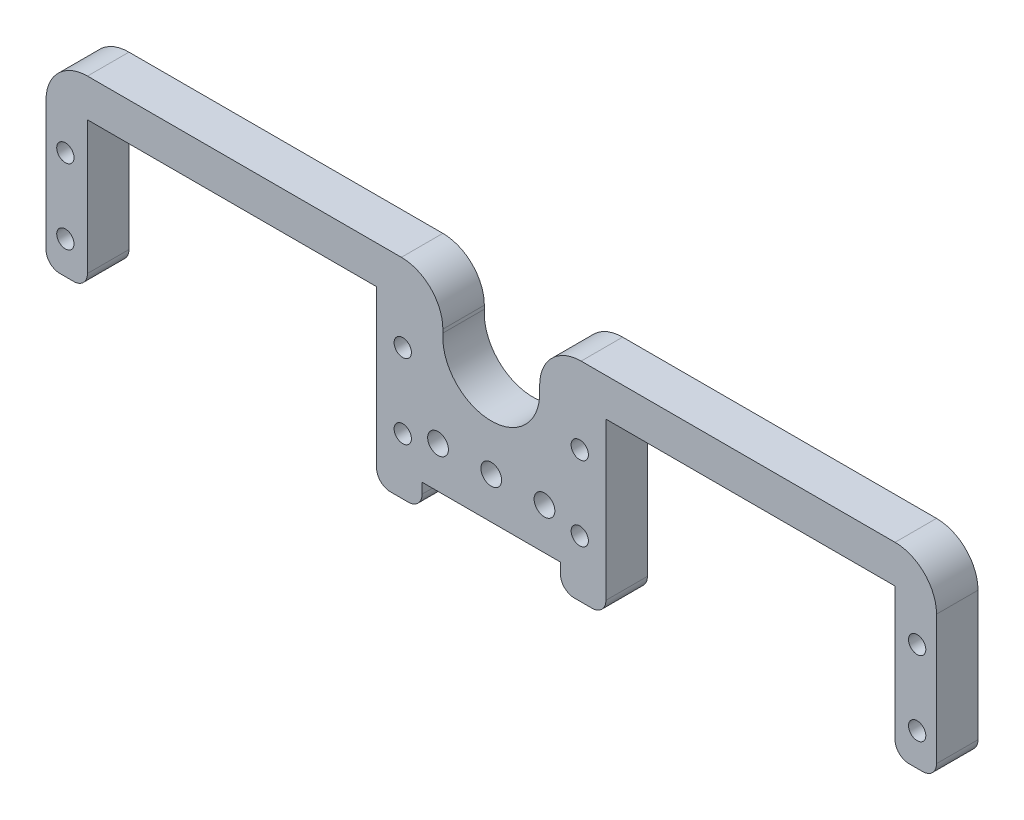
ISO-10303-21;
HEADER;
FILE_DESCRIPTION(('STEP AP214'),'2;1');
FILE_NAME('part.step','',(''),(''),'','','');
FILE_SCHEMA(('AUTOMOTIVE_DESIGN { 1 0 10303 214 1 1 1 1 }'));
ENDSEC;
DATA;
#1=APPLICATION_CONTEXT('core data for automotive mechanical design processes');
#2=APPLICATION_PROTOCOL_DEFINITION('international standard','automotive_design',2000,#1);
#3=PRODUCT_CONTEXT('',#1,'mechanical');
#4=PRODUCT('Part','Part','',(#3));
#5=PRODUCT_RELATED_PRODUCT_CATEGORY('part','',(#4));
#6=PRODUCT_DEFINITION_FORMATION('','',#4);
#7=PRODUCT_DEFINITION_CONTEXT('part definition',#1,'design');
#8=PRODUCT_DEFINITION('design','',#6,#7);
#9=PRODUCT_DEFINITION_SHAPE('','',#8);
#10=(LENGTH_UNIT() NAMED_UNIT(*) SI_UNIT(.MILLI.,.METRE.));
#11=(NAMED_UNIT(*) PLANE_ANGLE_UNIT() SI_UNIT($,.RADIAN.));
#12=(NAMED_UNIT(*) SI_UNIT($,.STERADIAN.) SOLID_ANGLE_UNIT());
#13=UNCERTAINTY_MEASURE_WITH_UNIT(LENGTH_MEASURE(1.E-05),#10,'distance_accuracy_value','');
#14=(GEOMETRIC_REPRESENTATION_CONTEXT(3) GLOBAL_UNCERTAINTY_ASSIGNED_CONTEXT((#13)) GLOBAL_UNIT_ASSIGNED_CONTEXT((#10,
#11,#12)) REPRESENTATION_CONTEXT('',''));
#15=CARTESIAN_POINT('',(0.,0.,0.));
#16=DIRECTION('',(0.,0.,1.));
#17=DIRECTION('',(1.,0.,0.));
#18=AXIS2_PLACEMENT_3D('',#15,#16,#17);
#19=CARTESIAN_POINT('',(212.755943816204,11.1985803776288,6.));
#20=DIRECTION('',(0.,0.,-1.));
#21=DIRECTION('',(-1.,0.,0.));
#22=AXIS2_PLACEMENT_3D('',#19,#20,#21);
#23=PLANE('',#22);
#24=CARTESIAN_POINT('',(288.942156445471,17.3754220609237,6.));
#25=DIRECTION('',(0.,0.,1.));
#26=DIRECTION('',(-1.,0.,0.));
#27=AXIS2_PLACEMENT_3D('',#24,#25,#26);
#28=CIRCLE('',#27,1.25000000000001);
#29=CARTESIAN_POINT('',(287.692156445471,17.3754220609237,6.));
#30=VERTEX_POINT('',#29);
#31=EDGE_CURVE('E561',#30,#30,#28,.T.);
#32=ORIENTED_EDGE('',*,*,#31,.F.);
#33=EDGE_LOOP('',(#32));
#34=FACE_BOUND('',#33,.T.);
#35=CARTESIAN_POINT('',(240.142156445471,17.3754220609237,6.));
#36=DIRECTION('',(0.,0.,1.));
#37=DIRECTION('',(-1.,0.,0.));
#38=AXIS2_PLACEMENT_3D('',#35,#36,#37);
#39=CIRCLE('',#38,1.25000000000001);
#40=CARTESIAN_POINT('',(238.892156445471,17.3754220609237,6.));
#41=VERTEX_POINT('',#40);
#42=EDGE_CURVE('E549',#41,#41,#39,.T.);
#43=ORIENTED_EDGE('',*,*,#42,.F.);
#44=EDGE_LOOP('',(#43));
#45=FACE_BOUND('',#44,.T.);
#46=CARTESIAN_POINT('',(227.342156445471,18.6985803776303,6.));
#47=DIRECTION('',(0.,0.,1.));
#48=DIRECTION('',(1.,0.,0.));
#49=AXIS2_PLACEMENT_3D('',#46,#47,#48);
#50=CIRCLE('',#49,1.5);
#51=CARTESIAN_POINT('',(228.842156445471,18.6985803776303,6.));
#52=VERTEX_POINT('',#51);
#53=EDGE_CURVE('E537',#52,#52,#50,.T.);
#54=ORIENTED_EDGE('',*,*,#53,.F.);
#55=EDGE_LOOP('',(#54));
#56=FACE_BOUND('',#55,.T.);
#57=CARTESIAN_POINT('',(165.742156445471,17.3754220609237,6.));
#58=DIRECTION('',(0.,0.,1.));
#59=DIRECTION('',(1.,0.,0.));
#60=AXIS2_PLACEMENT_3D('',#57,#58,#59);
#61=CIRCLE('',#60,1.25000000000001);
#62=CARTESIAN_POINT('',(166.992156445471,17.3754220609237,6.));
#63=VERTEX_POINT('',#62);
#64=EDGE_CURVE('E525',#63,#63,#61,.T.);
#65=ORIENTED_EDGE('',*,*,#64,.F.);
#66=EDGE_LOOP('',(#65));
#67=FACE_BOUND('',#66,.T.);
#68=CARTESIAN_POINT('',(214.542156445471,28.1654220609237,6.));
#69=DIRECTION('',(0.,0.,1.));
#70=DIRECTION('',(1.,0.,0.));
#71=AXIS2_PLACEMENT_3D('',#68,#69,#70);
#72=CIRCLE('',#71,1.25000000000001);
#73=CARTESIAN_POINT('',(215.792156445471,28.1654220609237,6.));
#74=VERTEX_POINT('',#73);
#75=EDGE_CURVE('E513',#74,#74,#72,.T.);
#76=ORIENTED_EDGE('',*,*,#75,.F.);
#77=EDGE_LOOP('',(#76));
#78=FACE_BOUND('',#77,.T.);
#79=DIRECTION('',(0.,1.,0.));
#80=VECTOR('',#79,1.);
#81=CARTESIAN_POINT('',(168.942156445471,32.8954220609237,6.));
#82=LINE('',#81,#80);
#83=CARTESIAN_POINT('',(168.942156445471,14.6454220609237,6.));
#84=VERTEX_POINT('',#83);
#85=CARTESIAN_POINT('',(168.942156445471,33.8954220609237,6.));
#86=VERTEX_POINT('',#85);
#87=EDGE_CURVE('E49',#84,#86,#82,.T.);
#88=ORIENTED_EDGE('',*,*,#87,.T.);
#89=DIRECTION('',(1.,0.,0.));
#90=VECTOR('',#89,1.);
#91=CARTESIAN_POINT('',(168.942156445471,33.8954220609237,6.));
#92=LINE('',#91,#90);
#93=CARTESIAN_POINT('',(210.755943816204,33.8954220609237,6.));
#94=VERTEX_POINT('',#93);
#95=EDGE_CURVE('E165',#86,#94,#92,.T.);
#96=ORIENTED_EDGE('',*,*,#95,.T.);
#97=DIRECTION('',(0.,-1.,0.));
#98=VECTOR('',#97,1.);
#99=CARTESIAN_POINT('',(210.755943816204,33.8954220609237,6.));
#100=LINE('',#99,#98);
#101=CARTESIAN_POINT('',(210.755943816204,11.1985803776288,6.));
#102=VERTEX_POINT('',#101);
#103=EDGE_CURVE('E426',#94,#102,#100,.T.);
#104=ORIENTED_EDGE('',*,*,#103,.T.);
#105=CARTESIAN_POINT('',(212.755943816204,11.1985803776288,6.));
#106=DIRECTION('',(0.,0.,1.));
#107=DIRECTION('',(-1.,0.,0.));
#108=AXIS2_PLACEMENT_3D('',#105,#106,#107);
#109=CIRCLE('',#108,2.);
#110=CARTESIAN_POINT('',(212.755943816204,9.19858037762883,6.));
#111=VERTEX_POINT('',#110);
#112=EDGE_CURVE('E446',#102,#111,#109,.T.);
#113=ORIENTED_EDGE('',*,*,#112,.T.);
#114=DIRECTION('',(1.,0.,0.));
#115=VECTOR('',#114,1.);
#116=CARTESIAN_POINT('',(212.755943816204,9.19858037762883,6.));
#117=LINE('',#116,#115);
#118=CARTESIAN_POINT('',(215.342156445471,9.19858037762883,6.));
#119=VERTEX_POINT('',#118);
#120=EDGE_CURVE('E443',#111,#119,#117,.T.);
#121=ORIENTED_EDGE('',*,*,#120,.T.);
#122=CARTESIAN_POINT('',(215.342156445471,11.1985803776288,6.));
#123=DIRECTION('',(0.,0.,1.));
#124=DIRECTION('',(-1.,0.,0.));
#125=AXIS2_PLACEMENT_3D('',#122,#123,#124);
#126=CIRCLE('',#125,2.);
#127=CARTESIAN_POINT('',(217.342156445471,11.1985803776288,6.));
#128=VERTEX_POINT('',#127);
#129=EDGE_CURVE('E445',#119,#128,#126,.T.);
#130=ORIENTED_EDGE('',*,*,#129,.T.);
#131=DIRECTION('',(0.,1.,0.));
#132=VECTOR('',#131,1.);
#133=CARTESIAN_POINT('',(217.342156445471,11.1985803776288,6.));
#134=LINE('',#133,#132);
#135=CARTESIAN_POINT('',(217.342156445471,12.6985803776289,6.));
#136=VERTEX_POINT('',#135);
#137=EDGE_CURVE('E448',#128,#136,#134,.T.);
#138=ORIENTED_EDGE('',*,*,#137,.T.);
#139=DIRECTION('',(1.,0.,0.));
#140=VECTOR('',#139,1.);
#141=CARTESIAN_POINT('',(217.342156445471,12.6985803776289,6.));
#142=LINE('',#141,#140);
#143=CARTESIAN_POINT('',(237.342156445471,12.6985803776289,6.));
#144=VERTEX_POINT('',#143);
#145=EDGE_CURVE('E454',#136,#144,#142,.T.);
#146=ORIENTED_EDGE('',*,*,#145,.T.);
#147=DIRECTION('',(0.,-1.,0.));
#148=VECTOR('',#147,1.);
#149=CARTESIAN_POINT('',(237.342156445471,11.1985803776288,6.));
#150=LINE('',#149,#148);
#151=CARTESIAN_POINT('',(237.342156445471,11.1985803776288,6.));
#152=VERTEX_POINT('',#151);
#153=EDGE_CURVE('E456',#144,#152,#150,.T.);
#154=ORIENTED_EDGE('',*,*,#153,.T.);
#155=CARTESIAN_POINT('',(239.342156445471,11.1985803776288,6.));
#156=DIRECTION('',(0.,0.,1.));
#157=DIRECTION('',(-1.,0.,0.));
#158=AXIS2_PLACEMENT_3D('',#155,#156,#157);
#159=CIRCLE('',#158,2.);
#160=CARTESIAN_POINT('',(239.342156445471,9.19858037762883,6.));
#161=VERTEX_POINT('',#160);
#162=EDGE_CURVE('E458',#152,#161,#159,.T.);
#163=ORIENTED_EDGE('',*,*,#162,.T.);
#164=DIRECTION('',(1.,0.,0.));
#165=VECTOR('',#164,1.);
#166=CARTESIAN_POINT('',(241.928369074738,9.19858037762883,6.));
#167=LINE('',#166,#165);
#168=CARTESIAN_POINT('',(241.928369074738,9.19858037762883,6.));
#169=VERTEX_POINT('',#168);
#170=EDGE_CURVE('E460',#161,#169,#167,.T.);
#171=ORIENTED_EDGE('',*,*,#170,.T.);
#172=CARTESIAN_POINT('',(241.928369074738,11.1985803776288,6.));
#173=DIRECTION('',(0.,0.,1.));
#174=DIRECTION('',(-1.,0.,0.));
#175=AXIS2_PLACEMENT_3D('',#172,#173,#174);
#176=CIRCLE('',#175,2.);
#177=CARTESIAN_POINT('',(243.928369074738,11.1985803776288,6.));
#178=VERTEX_POINT('',#177);
#179=EDGE_CURVE('E462',#169,#178,#176,.T.);
#180=ORIENTED_EDGE('',*,*,#179,.T.);
#181=DIRECTION('',(0.,1.,0.));
#182=VECTOR('',#181,1.);
#183=CARTESIAN_POINT('',(243.928369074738,33.8954220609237,6.));
#184=LINE('',#183,#182);
#185=CARTESIAN_POINT('',(243.928369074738,33.8954220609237,6.));
#186=VERTEX_POINT('',#185);
#187=EDGE_CURVE('E464',#178,#186,#184,.T.);
#188=ORIENTED_EDGE('',*,*,#187,.T.);
#189=DIRECTION('',(1.,0.,0.));
#190=VECTOR('',#189,1.);
#191=CARTESIAN_POINT('',(285.742156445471,33.8954220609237,6.));
#192=LINE('',#191,#190);
#193=CARTESIAN_POINT('',(285.742156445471,33.8954220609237,6.));
#194=VERTEX_POINT('',#193);
#195=EDGE_CURVE('E466',#186,#194,#192,.T.);
#196=ORIENTED_EDGE('',*,*,#195,.T.);
#197=DIRECTION('',(0.,-1.,0.));
#198=VECTOR('',#197,1.);
#199=CARTESIAN_POINT('',(285.742156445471,32.8954220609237,6.));
#200=LINE('',#199,#198);
#201=CARTESIAN_POINT('',(285.742156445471,14.6454220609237,6.));
#202=VERTEX_POINT('',#201);
#203=EDGE_CURVE('E468',#194,#202,#200,.T.);
#204=ORIENTED_EDGE('',*,*,#203,.T.);
#205=CARTESIAN_POINT('',(287.742156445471,14.6454220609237,6.));
#206=DIRECTION('',(0.,0.,1.));
#207=DIRECTION('',(1.,0.,0.));
#208=AXIS2_PLACEMENT_3D('',#205,#206,#207);
#209=CIRCLE('',#208,2.);
#210=CARTESIAN_POINT('',(287.742156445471,12.6454220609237,6.));
#211=VERTEX_POINT('',#210);
#212=EDGE_CURVE('E470',#202,#211,#209,.T.);
#213=ORIENTED_EDGE('',*,*,#212,.T.);
#214=DIRECTION('',(1.,0.,0.));
#215=VECTOR('',#214,1.);
#216=CARTESIAN_POINT('',(289.742156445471,12.6454220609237,6.));
#217=LINE('',#216,#215);
#218=CARTESIAN_POINT('',(289.742156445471,12.6454220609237,6.));
#219=VERTEX_POINT('',#218);
#220=EDGE_CURVE('E472',#211,#219,#217,.T.);
#221=ORIENTED_EDGE('',*,*,#220,.T.);
#222=CARTESIAN_POINT('',(289.742156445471,14.6454220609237,6.));
#223=DIRECTION('',(0.,0.,1.));
#224=DIRECTION('',(-1.,0.,0.));
#225=AXIS2_PLACEMENT_3D('',#222,#223,#224);
#226=CIRCLE('',#225,2.);
#227=CARTESIAN_POINT('',(291.742156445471,14.6454220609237,6.));
#228=VERTEX_POINT('',#227);
#229=EDGE_CURVE('E474',#219,#228,#226,.T.);
#230=ORIENTED_EDGE('',*,*,#229,.T.);
#231=DIRECTION('',(0.,1.,0.));
#232=VECTOR('',#231,1.);
#233=CARTESIAN_POINT('',(291.742156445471,14.6454220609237,6.));
#234=LINE('',#233,#232);
#235=CARTESIAN_POINT('',(291.742156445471,33.3704754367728,6.));
#236=VERTEX_POINT('',#235);
#237=EDGE_CURVE('E476',#228,#236,#234,.T.);
#238=ORIENTED_EDGE('',*,*,#237,.T.);
#239=CARTESIAN_POINT('',(285.742156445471,33.3704754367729,6.));
#240=DIRECTION('',(0.,0.,1.));
#241=DIRECTION('',(1.,0.,0.));
#242=AXIS2_PLACEMENT_3D('',#239,#240,#241);
#243=CIRCLE('',#242,6.);
#244=CARTESIAN_POINT('',(285.742156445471,39.3704754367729,6.));
#245=VERTEX_POINT('',#244);
#246=EDGE_CURVE('E478',#236,#245,#243,.T.);
#247=ORIENTED_EDGE('',*,*,#246,.T.);
#248=DIRECTION('',(-1.,0.,0.));
#249=VECTOR('',#248,1.);
#250=CARTESIAN_POINT('',(240.342156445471,39.3704754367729,6.));
#251=LINE('',#250,#249);
#252=CARTESIAN_POINT('',(240.342156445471,39.3704754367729,6.));
#253=VERTEX_POINT('',#252);
#254=EDGE_CURVE('E480',#245,#253,#251,.T.);
#255=ORIENTED_EDGE('',*,*,#254,.T.);
#256=CARTESIAN_POINT('',(240.342156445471,33.3704754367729,6.));
#257=DIRECTION('',(0.,0.,1.));
#258=DIRECTION('',(1.,0.,0.));
#259=AXIS2_PLACEMENT_3D('',#256,#257,#258);
#260=CIRCLE('',#259,6.);
#261=CARTESIAN_POINT('',(234.342156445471,33.3704754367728,6.));
#262=VERTEX_POINT('',#261);
#263=EDGE_CURVE('E482',#253,#262,#260,.T.);
#264=ORIENTED_EDGE('',*,*,#263,.T.);
#265=DIRECTION('',(0.,-1.,0.));
#266=VECTOR('',#265,1.);
#267=CARTESIAN_POINT('',(234.342156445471,32.87376433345,6.));
#268=LINE('',#267,#266);
#269=CARTESIAN_POINT('',(234.342156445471,32.87376433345,6.));
#270=VERTEX_POINT('',#269);
#271=EDGE_CURVE('E484',#262,#270,#268,.T.);
#272=ORIENTED_EDGE('',*,*,#271,.T.);
#273=CARTESIAN_POINT('',(227.342156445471,32.3873546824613,6.));
#274=DIRECTION('',(0.,0.,-1.));
#275=DIRECTION('',(1.,0.,0.));
#276=AXIS2_PLACEMENT_3D('',#273,#274,#275);
#277=CIRCLE('',#276,7.01687924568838);
#278=CARTESIAN_POINT('',(220.342156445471,32.87376433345,6.));
#279=VERTEX_POINT('',#278);
#280=EDGE_CURVE('E486',#270,#279,#277,.T.);
#281=ORIENTED_EDGE('',*,*,#280,.T.);
#282=DIRECTION('',(0.,1.,0.));
#283=VECTOR('',#282,1.);
#284=CARTESIAN_POINT('',(220.342156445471,32.87376433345,6.));
#285=LINE('',#284,#283);
#286=CARTESIAN_POINT('',(220.342156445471,33.3704754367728,6.));
#287=VERTEX_POINT('',#286);
#288=EDGE_CURVE('E488',#279,#287,#285,.T.);
#289=ORIENTED_EDGE('',*,*,#288,.T.);
#290=CARTESIAN_POINT('',(214.342156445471,33.3704754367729,6.));
#291=DIRECTION('',(0.,0.,1.));
#292=DIRECTION('',(1.,0.,0.));
#293=AXIS2_PLACEMENT_3D('',#290,#291,#292);
#294=CIRCLE('',#293,6.);
#295=CARTESIAN_POINT('',(214.342156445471,39.3704754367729,6.));
#296=VERTEX_POINT('',#295);
#297=EDGE_CURVE('E490',#287,#296,#294,.T.);
#298=ORIENTED_EDGE('',*,*,#297,.T.);
#299=DIRECTION('',(-1.,0.,0.));
#300=VECTOR('',#299,1.);
#301=CARTESIAN_POINT('',(168.942156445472,39.3704754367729,6.));
#302=LINE('',#301,#300);
#303=CARTESIAN_POINT('',(168.942156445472,39.3704754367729,6.));
#304=VERTEX_POINT('',#303);
#305=EDGE_CURVE('E492',#296,#304,#302,.T.);
#306=ORIENTED_EDGE('',*,*,#305,.T.);
#307=CARTESIAN_POINT('',(168.942156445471,33.3704754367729,6.));
#308=DIRECTION('',(0.,0.,1.));
#309=DIRECTION('',(-1.,0.,0.));
#310=AXIS2_PLACEMENT_3D('',#307,#308,#309);
#311=CIRCLE('',#310,6.);
#312=CARTESIAN_POINT('',(162.942156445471,33.3704754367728,6.));
#313=VERTEX_POINT('',#312);
#314=EDGE_CURVE('E494',#304,#313,#311,.T.);
#315=ORIENTED_EDGE('',*,*,#314,.T.);
#316=DIRECTION('',(0.,-1.,0.));
#317=VECTOR('',#316,1.);
#318=CARTESIAN_POINT('',(162.942156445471,14.6454220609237,6.));
#319=LINE('',#318,#317);
#320=CARTESIAN_POINT('',(162.942156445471,14.6454220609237,6.));
#321=VERTEX_POINT('',#320);
#322=EDGE_CURVE('E257',#313,#321,#319,.T.);
#323=ORIENTED_EDGE('',*,*,#322,.T.);
#324=CARTESIAN_POINT('',(164.942156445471,14.6454220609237,6.));
#325=DIRECTION('',(0.,0.,1.));
#326=DIRECTION('',(-1.,0.,0.));
#327=AXIS2_PLACEMENT_3D('',#324,#325,#326);
#328=CIRCLE('',#327,2.);
#329=CARTESIAN_POINT('',(164.942156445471,12.6454220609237,6.));
#330=VERTEX_POINT('',#329);
#331=EDGE_CURVE('E251',#321,#330,#328,.T.);
#332=ORIENTED_EDGE('',*,*,#331,.T.);
#333=DIRECTION('',(1.,0.,0.));
#334=VECTOR('',#333,1.);
#335=CARTESIAN_POINT('',(164.942156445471,12.6454220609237,6.));
#336=LINE('',#335,#334);
#337=CARTESIAN_POINT('',(166.942156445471,12.6454220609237,6.));
#338=VERTEX_POINT('',#337);
#339=EDGE_CURVE('E255',#330,#338,#336,.T.);
#340=ORIENTED_EDGE('',*,*,#339,.T.);
#341=CARTESIAN_POINT('',(166.942156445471,14.6454220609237,6.));
#342=DIRECTION('',(0.,0.,1.));
#343=DIRECTION('',(-1.,0.,0.));
#344=AXIS2_PLACEMENT_3D('',#341,#342,#343);
#345=CIRCLE('',#344,2.);
#346=EDGE_CURVE('E271',#338,#84,#345,.T.);
#347=ORIENTED_EDGE('',*,*,#346,.T.);
#348=EDGE_LOOP('',(#88,#96,#104,#113,#121,#130,#138,#146,#154,#163,#171,#180,#188,#196,#204,
#213,#221,#230,#238,#247,#255,#264,#272,#281,#289,#298,#306,#315,#323,#332,#340,#347));
#349=FACE_BOUND('',#348,.T.);
#350=CARTESIAN_POINT('',(214.542156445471,17.3754220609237,6.));
#351=DIRECTION('',(0.,0.,1.));
#352=DIRECTION('',(1.,0.,0.));
#353=AXIS2_PLACEMENT_3D('',#350,#351,#352);
#354=CIRCLE('',#353,1.25000000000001);
#355=CARTESIAN_POINT('',(215.792156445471,17.3754220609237,6.));
#356=VERTEX_POINT('',#355);
#357=EDGE_CURVE('E280',#356,#356,#354,.T.);
#358=ORIENTED_EDGE('',*,*,#357,.F.);
#359=EDGE_LOOP('',(#358));
#360=FACE_BOUND('',#359,.T.);
#361=CARTESIAN_POINT('',(165.742156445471,28.1654220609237,6.));
#362=DIRECTION('',(0.,0.,1.));
#363=DIRECTION('',(1.,0.,0.));
#364=AXIS2_PLACEMENT_3D('',#361,#362,#363);
#365=CIRCLE('',#364,1.25000000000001);
#366=CARTESIAN_POINT('',(166.992156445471,28.1654220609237,6.));
#367=VERTEX_POINT('',#366);
#368=EDGE_CURVE('E519',#367,#367,#365,.T.);
#369=ORIENTED_EDGE('',*,*,#368,.F.);
#370=EDGE_LOOP('',(#369));
#371=FACE_BOUND('',#370,.T.);
#372=CARTESIAN_POINT('',(219.644215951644,18.6985803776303,6.));
#373=DIRECTION('',(0.,0.,1.));
#374=DIRECTION('',(1.,0.,0.));
#375=AXIS2_PLACEMENT_3D('',#372,#373,#374);
#376=CIRCLE('',#375,1.5);
#377=CARTESIAN_POINT('',(221.144215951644,18.6985803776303,6.));
#378=VERTEX_POINT('',#377);
#379=EDGE_CURVE('E531',#378,#378,#376,.T.);
#380=ORIENTED_EDGE('',*,*,#379,.F.);
#381=EDGE_LOOP('',(#380));
#382=FACE_BOUND('',#381,.T.);
#383=CARTESIAN_POINT('',(235.040096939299,18.6985803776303,6.));
#384=DIRECTION('',(0.,0.,1.));
#385=DIRECTION('',(1.,0.,0.));
#386=AXIS2_PLACEMENT_3D('',#383,#384,#385);
#387=CIRCLE('',#386,1.5);
#388=CARTESIAN_POINT('',(236.540096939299,18.6985803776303,6.));
#389=VERTEX_POINT('',#388);
#390=EDGE_CURVE('E543',#389,#389,#387,.T.);
#391=ORIENTED_EDGE('',*,*,#390,.F.);
#392=EDGE_LOOP('',(#391));
#393=FACE_BOUND('',#392,.T.);
#394=CARTESIAN_POINT('',(240.142156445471,28.1654220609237,6.));
#395=DIRECTION('',(0.,0.,1.));
#396=DIRECTION('',(-1.,0.,0.));
#397=AXIS2_PLACEMENT_3D('',#394,#395,#396);
#398=CIRCLE('',#397,1.25000000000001);
#399=CARTESIAN_POINT('',(238.892156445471,28.1654220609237,6.));
#400=VERTEX_POINT('',#399);
#401=EDGE_CURVE('E555',#400,#400,#398,.T.);
#402=ORIENTED_EDGE('',*,*,#401,.F.);
#403=EDGE_LOOP('',(#402));
#404=FACE_BOUND('',#403,.T.);
#405=CARTESIAN_POINT('',(288.942156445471,28.1654220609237,6.));
#406=DIRECTION('',(0.,0.,1.));
#407=DIRECTION('',(-1.,0.,0.));
#408=AXIS2_PLACEMENT_3D('',#405,#406,#407);
#409=CIRCLE('',#408,1.25000000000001);
#410=CARTESIAN_POINT('',(287.692156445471,28.1654220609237,6.));
#411=VERTEX_POINT('',#410);
#412=EDGE_CURVE('E567',#411,#411,#409,.T.);
#413=ORIENTED_EDGE('',*,*,#412,.F.);
#414=EDGE_LOOP('',(#413));
#415=FACE_BOUND('',#414,.T.);
#416=ADVANCED_FACE('F32',(#34,#45,#56,#67,#78,#349,#360,#371,#382,#393,#404,#415),#23,.F.);
#417=CARTESIAN_POINT('',(212.755943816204,11.1985803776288,0.));
#418=DIRECTION('',(0.,0.,-1.));
#419=DIRECTION('',(-1.,0.,0.));
#420=AXIS2_PLACEMENT_3D('',#417,#418,#419);
#421=PLANE('',#420);
#422=CARTESIAN_POINT('',(288.942156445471,17.3754220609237,0.));
#423=DIRECTION('',(0.,0.,1.));
#424=DIRECTION('',(-1.,0.,0.));
#425=AXIS2_PLACEMENT_3D('',#422,#423,#424);
#426=CIRCLE('',#425,1.25000000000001);
#427=CARTESIAN_POINT('',(287.692156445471,17.3754220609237,0.));
#428=VERTEX_POINT('',#427);
#429=EDGE_CURVE('E564',#428,#428,#426,.T.);
#430=ORIENTED_EDGE('',*,*,#429,.T.);
#431=EDGE_LOOP('',(#430));
#432=FACE_BOUND('',#431,.T.);
#433=CARTESIAN_POINT('',(240.142156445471,17.3754220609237,0.));
#434=DIRECTION('',(0.,0.,1.));
#435=DIRECTION('',(-1.,0.,0.));
#436=AXIS2_PLACEMENT_3D('',#433,#434,#435);
#437=CIRCLE('',#436,1.25000000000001);
#438=CARTESIAN_POINT('',(238.892156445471,17.3754220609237,0.));
#439=VERTEX_POINT('',#438);
#440=EDGE_CURVE('E552',#439,#439,#437,.T.);
#441=ORIENTED_EDGE('',*,*,#440,.T.);
#442=EDGE_LOOP('',(#441));
#443=FACE_BOUND('',#442,.T.);
#444=CARTESIAN_POINT('',(227.342156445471,18.6985803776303,0.));
#445=DIRECTION('',(0.,0.,1.));
#446=DIRECTION('',(1.,0.,0.));
#447=AXIS2_PLACEMENT_3D('',#444,#445,#446);
#448=CIRCLE('',#447,1.5);
#449=CARTESIAN_POINT('',(228.842156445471,18.6985803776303,0.));
#450=VERTEX_POINT('',#449);
#451=EDGE_CURVE('E540',#450,#450,#448,.T.);
#452=ORIENTED_EDGE('',*,*,#451,.T.);
#453=EDGE_LOOP('',(#452));
#454=FACE_BOUND('',#453,.T.);
#455=CARTESIAN_POINT('',(165.742156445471,17.3754220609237,0.));
#456=DIRECTION('',(0.,0.,1.));
#457=DIRECTION('',(1.,0.,0.));
#458=AXIS2_PLACEMENT_3D('',#455,#456,#457);
#459=CIRCLE('',#458,1.25000000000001);
#460=CARTESIAN_POINT('',(166.992156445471,17.3754220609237,0.));
#461=VERTEX_POINT('',#460);
#462=EDGE_CURVE('E528',#461,#461,#459,.T.);
#463=ORIENTED_EDGE('',*,*,#462,.T.);
#464=EDGE_LOOP('',(#463));
#465=FACE_BOUND('',#464,.T.);
#466=CARTESIAN_POINT('',(214.542156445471,28.1654220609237,0.));
#467=DIRECTION('',(0.,0.,1.));
#468=DIRECTION('',(1.,0.,0.));
#469=AXIS2_PLACEMENT_3D('',#466,#467,#468);
#470=CIRCLE('',#469,1.25000000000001);
#471=CARTESIAN_POINT('',(215.792156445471,28.1654220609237,0.));
#472=VERTEX_POINT('',#471);
#473=EDGE_CURVE('E516',#472,#472,#470,.T.);
#474=ORIENTED_EDGE('',*,*,#473,.T.);
#475=EDGE_LOOP('',(#474));
#476=FACE_BOUND('',#475,.T.);
#477=DIRECTION('',(1.,0.,0.));
#478=VECTOR('',#477,1.);
#479=CARTESIAN_POINT('',(168.942156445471,33.8954220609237,0.));
#480=LINE('',#479,#478);
#481=CARTESIAN_POINT('',(168.942156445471,33.8954220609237,0.));
#482=VERTEX_POINT('',#481);
#483=CARTESIAN_POINT('',(210.755943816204,33.8954220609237,0.));
#484=VERTEX_POINT('',#483);
#485=EDGE_CURVE('E277',#482,#484,#480,.T.);
#486=ORIENTED_EDGE('',*,*,#485,.F.);
#487=DIRECTION('',(0.,1.,0.));
#488=VECTOR('',#487,1.);
#489=CARTESIAN_POINT('',(168.942156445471,14.6454220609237,0.));
#490=LINE('',#489,#488);
#491=CARTESIAN_POINT('',(168.942156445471,14.6454220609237,0.));
#492=VERTEX_POINT('',#491);
#493=EDGE_CURVE('E338',#492,#482,#490,.T.);
#494=ORIENTED_EDGE('',*,*,#493,.F.);
#495=CARTESIAN_POINT('',(166.942156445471,14.6454220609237,0.));
#496=DIRECTION('',(0.,0.,1.));
#497=DIRECTION('',(-1.,0.,0.));
#498=AXIS2_PLACEMENT_3D('',#495,#496,#497);
#499=CIRCLE('',#498,2.);
#500=CARTESIAN_POINT('',(166.942156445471,12.6454220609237,0.));
#501=VERTEX_POINT('',#500);
#502=EDGE_CURVE('E158',#501,#492,#499,.T.);
#503=ORIENTED_EDGE('',*,*,#502,.F.);
#504=DIRECTION('',(1.,0.,0.));
#505=VECTOR('',#504,1.);
#506=CARTESIAN_POINT('',(164.942156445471,12.6454220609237,0.));
#507=LINE('',#506,#505);
#508=CARTESIAN_POINT('',(164.942156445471,12.6454220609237,0.));
#509=VERTEX_POINT('',#508);
#510=EDGE_CURVE('E151',#509,#501,#507,.T.);
#511=ORIENTED_EDGE('',*,*,#510,.F.);
#512=CARTESIAN_POINT('',(164.942156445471,14.6454220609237,0.));
#513=DIRECTION('',(0.,0.,1.));
#514=DIRECTION('',(-1.,0.,0.));
#515=AXIS2_PLACEMENT_3D('',#512,#513,#514);
#516=CIRCLE('',#515,2.);
#517=CARTESIAN_POINT('',(162.942156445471,14.6454220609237,0.));
#518=VERTEX_POINT('',#517);
#519=EDGE_CURVE('E265',#518,#509,#516,.T.);
#520=ORIENTED_EDGE('',*,*,#519,.F.);
#521=DIRECTION('',(0.,-1.,0.));
#522=VECTOR('',#521,1.);
#523=CARTESIAN_POINT('',(162.942156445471,14.6454220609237,0.));
#524=LINE('',#523,#522);
#525=CARTESIAN_POINT('',(162.942156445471,33.3704754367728,0.));
#526=VERTEX_POINT('',#525);
#527=EDGE_CURVE('E333',#526,#518,#524,.T.);
#528=ORIENTED_EDGE('',*,*,#527,.F.);
#529=CARTESIAN_POINT('',(168.942156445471,33.3704754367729,0.));
#530=DIRECTION('',(0.,0.,1.));
#531=DIRECTION('',(-1.,0.,0.));
#532=AXIS2_PLACEMENT_3D('',#529,#530,#531);
#533=CIRCLE('',#532,6.);
#534=CARTESIAN_POINT('',(168.942156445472,39.3704754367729,0.));
#535=VERTEX_POINT('',#534);
#536=EDGE_CURVE('E331',#535,#526,#533,.T.);
#537=ORIENTED_EDGE('',*,*,#536,.F.);
#538=DIRECTION('',(-1.,0.,0.));
#539=VECTOR('',#538,1.);
#540=CARTESIAN_POINT('',(168.942156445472,39.3704754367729,0.));
#541=LINE('',#540,#539);
#542=CARTESIAN_POINT('',(214.342156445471,39.3704754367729,0.));
#543=VERTEX_POINT('',#542);
#544=EDGE_CURVE('E329',#543,#535,#541,.T.);
#545=ORIENTED_EDGE('',*,*,#544,.F.);
#546=CARTESIAN_POINT('',(214.342156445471,33.3704754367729,0.));
#547=DIRECTION('',(0.,0.,1.));
#548=DIRECTION('',(1.,0.,0.));
#549=AXIS2_PLACEMENT_3D('',#546,#547,#548);
#550=CIRCLE('',#549,6.);
#551=CARTESIAN_POINT('',(220.342156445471,33.3704754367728,0.));
#552=VERTEX_POINT('',#551);
#553=EDGE_CURVE('E327',#552,#543,#550,.T.);
#554=ORIENTED_EDGE('',*,*,#553,.F.);
#555=DIRECTION('',(0.,1.,0.));
#556=VECTOR('',#555,1.);
#557=CARTESIAN_POINT('',(220.342156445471,32.87376433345,0.));
#558=LINE('',#557,#556);
#559=CARTESIAN_POINT('',(220.342156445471,32.87376433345,0.));
#560=VERTEX_POINT('',#559);
#561=EDGE_CURVE('E325',#560,#552,#558,.T.);
#562=ORIENTED_EDGE('',*,*,#561,.F.);
#563=CARTESIAN_POINT('',(227.342156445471,32.3873546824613,0.));
#564=DIRECTION('',(0.,0.,-1.));
#565=DIRECTION('',(1.,0.,0.));
#566=AXIS2_PLACEMENT_3D('',#563,#564,#565);
#567=CIRCLE('',#566,7.01687924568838);
#568=CARTESIAN_POINT('',(234.342156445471,32.87376433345,0.));
#569=VERTEX_POINT('',#568);
#570=EDGE_CURVE('E323',#569,#560,#567,.T.);
#571=ORIENTED_EDGE('',*,*,#570,.F.);
#572=DIRECTION('',(0.,-1.,0.));
#573=VECTOR('',#572,1.);
#574=CARTESIAN_POINT('',(234.342156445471,32.87376433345,0.));
#575=LINE('',#574,#573);
#576=CARTESIAN_POINT('',(234.342156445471,33.3704754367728,0.));
#577=VERTEX_POINT('',#576);
#578=EDGE_CURVE('E321',#577,#569,#575,.T.);
#579=ORIENTED_EDGE('',*,*,#578,.F.);
#580=CARTESIAN_POINT('',(240.342156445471,33.3704754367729,0.));
#581=DIRECTION('',(0.,0.,1.));
#582=DIRECTION('',(1.,0.,0.));
#583=AXIS2_PLACEMENT_3D('',#580,#581,#582);
#584=CIRCLE('',#583,6.);
#585=CARTESIAN_POINT('',(240.342156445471,39.3704754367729,0.));
#586=VERTEX_POINT('',#585);
#587=EDGE_CURVE('E319',#586,#577,#584,.T.);
#588=ORIENTED_EDGE('',*,*,#587,.F.);
#589=DIRECTION('',(-1.,0.,0.));
#590=VECTOR('',#589,1.);
#591=CARTESIAN_POINT('',(240.342156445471,39.3704754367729,0.));
#592=LINE('',#591,#590);
#593=CARTESIAN_POINT('',(285.742156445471,39.3704754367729,0.));
#594=VERTEX_POINT('',#593);
#595=EDGE_CURVE('E317',#594,#586,#592,.T.);
#596=ORIENTED_EDGE('',*,*,#595,.F.);
#597=CARTESIAN_POINT('',(285.742156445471,33.3704754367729,0.));
#598=DIRECTION('',(0.,0.,1.));
#599=DIRECTION('',(1.,0.,0.));
#600=AXIS2_PLACEMENT_3D('',#597,#598,#599);
#601=CIRCLE('',#600,6.);
#602=CARTESIAN_POINT('',(291.742156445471,33.3704754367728,0.));
#603=VERTEX_POINT('',#602);
#604=EDGE_CURVE('E315',#603,#594,#601,.T.);
#605=ORIENTED_EDGE('',*,*,#604,.F.);
#606=DIRECTION('',(0.,1.,0.));
#607=VECTOR('',#606,1.);
#608=CARTESIAN_POINT('',(291.742156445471,14.6454220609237,0.));
#609=LINE('',#608,#607);
#610=CARTESIAN_POINT('',(291.742156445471,14.6454220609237,0.));
#611=VERTEX_POINT('',#610);
#612=EDGE_CURVE('E313',#611,#603,#609,.T.);
#613=ORIENTED_EDGE('',*,*,#612,.F.);
#614=CARTESIAN_POINT('',(289.742156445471,14.6454220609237,0.));
#615=DIRECTION('',(0.,0.,1.));
#616=DIRECTION('',(-1.,0.,0.));
#617=AXIS2_PLACEMENT_3D('',#614,#615,#616);
#618=CIRCLE('',#617,2.);
#619=CARTESIAN_POINT('',(289.742156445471,12.6454220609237,0.));
#620=VERTEX_POINT('',#619);
#621=EDGE_CURVE('E311',#620,#611,#618,.T.);
#622=ORIENTED_EDGE('',*,*,#621,.F.);
#623=DIRECTION('',(1.,0.,0.));
#624=VECTOR('',#623,1.);
#625=CARTESIAN_POINT('',(289.742156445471,12.6454220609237,0.));
#626=LINE('',#625,#624);
#627=CARTESIAN_POINT('',(287.742156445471,12.6454220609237,0.));
#628=VERTEX_POINT('',#627);
#629=EDGE_CURVE('E309',#628,#620,#626,.T.);
#630=ORIENTED_EDGE('',*,*,#629,.F.);
#631=CARTESIAN_POINT('',(287.742156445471,14.6454220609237,0.));
#632=DIRECTION('',(0.,0.,1.));
#633=DIRECTION('',(1.,0.,0.));
#634=AXIS2_PLACEMENT_3D('',#631,#632,#633);
#635=CIRCLE('',#634,2.);
#636=CARTESIAN_POINT('',(285.742156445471,14.6454220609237,0.));
#637=VERTEX_POINT('',#636);
#638=EDGE_CURVE('E307',#637,#628,#635,.T.);
#639=ORIENTED_EDGE('',*,*,#638,.F.);
#640=DIRECTION('',(0.,-1.,0.));
#641=VECTOR('',#640,1.);
#642=CARTESIAN_POINT('',(285.742156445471,14.6454220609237,0.));
#643=LINE('',#642,#641);
#644=CARTESIAN_POINT('',(285.742156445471,33.8954220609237,0.));
#645=VERTEX_POINT('',#644);
#646=EDGE_CURVE('E305',#645,#637,#643,.T.);
#647=ORIENTED_EDGE('',*,*,#646,.F.);
#648=DIRECTION('',(1.,0.,0.));
#649=VECTOR('',#648,1.);
#650=CARTESIAN_POINT('',(285.742156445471,33.8954220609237,0.));
#651=LINE('',#650,#649);
#652=CARTESIAN_POINT('',(243.928369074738,33.8954220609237,0.));
#653=VERTEX_POINT('',#652);
#654=EDGE_CURVE('E302',#653,#645,#651,.T.);
#655=ORIENTED_EDGE('',*,*,#654,.F.);
#656=DIRECTION('',(0.,1.,0.));
#657=VECTOR('',#656,1.);
#658=CARTESIAN_POINT('',(243.928369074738,33.8954220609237,0.));
#659=LINE('',#658,#657);
#660=CARTESIAN_POINT('',(243.928369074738,11.1985803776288,0.));
#661=VERTEX_POINT('',#660);
#662=EDGE_CURVE('E300',#661,#653,#659,.T.);
#663=ORIENTED_EDGE('',*,*,#662,.F.);
#664=CARTESIAN_POINT('',(241.928369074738,11.1985803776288,0.));
#665=DIRECTION('',(0.,0.,1.));
#666=DIRECTION('',(-1.,0.,0.));
#667=AXIS2_PLACEMENT_3D('',#664,#665,#666);
#668=CIRCLE('',#667,2.);
#669=CARTESIAN_POINT('',(241.928369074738,9.19858037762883,0.));
#670=VERTEX_POINT('',#669);
#671=EDGE_CURVE('E298',#670,#661,#668,.T.);
#672=ORIENTED_EDGE('',*,*,#671,.F.);
#673=DIRECTION('',(1.,0.,0.));
#674=VECTOR('',#673,1.);
#675=CARTESIAN_POINT('',(241.928369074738,9.19858037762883,0.));
#676=LINE('',#675,#674);
#677=CARTESIAN_POINT('',(239.342156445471,9.19858037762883,0.));
#678=VERTEX_POINT('',#677);
#679=EDGE_CURVE('E296',#678,#670,#676,.T.);
#680=ORIENTED_EDGE('',*,*,#679,.F.);
#681=CARTESIAN_POINT('',(239.342156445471,11.1985803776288,0.));
#682=DIRECTION('',(0.,0.,1.));
#683=DIRECTION('',(-1.,0.,0.));
#684=AXIS2_PLACEMENT_3D('',#681,#682,#683);
#685=CIRCLE('',#684,2.);
#686=CARTESIAN_POINT('',(237.342156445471,11.1985803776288,0.));
#687=VERTEX_POINT('',#686);
#688=EDGE_CURVE('E294',#687,#678,#685,.T.);
#689=ORIENTED_EDGE('',*,*,#688,.F.);
#690=DIRECTION('',(0.,-1.,0.));
#691=VECTOR('',#690,1.);
#692=CARTESIAN_POINT('',(237.342156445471,11.1985803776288,0.));
#693=LINE('',#692,#691);
#694=CARTESIAN_POINT('',(237.342156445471,12.6985803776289,0.));
#695=VERTEX_POINT('',#694);
#696=EDGE_CURVE('E292',#695,#687,#693,.T.);
#697=ORIENTED_EDGE('',*,*,#696,.F.);
#698=DIRECTION('',(1.,0.,0.));
#699=VECTOR('',#698,1.);
#700=CARTESIAN_POINT('',(217.342156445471,12.6985803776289,0.));
#701=LINE('',#700,#699);
#702=CARTESIAN_POINT('',(217.342156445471,12.6985803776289,0.));
#703=VERTEX_POINT('',#702);
#704=EDGE_CURVE('E290',#703,#695,#701,.T.);
#705=ORIENTED_EDGE('',*,*,#704,.F.);
#706=DIRECTION('',(0.,1.,0.));
#707=VECTOR('',#706,1.);
#708=CARTESIAN_POINT('',(217.342156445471,11.1985803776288,0.));
#709=LINE('',#708,#707);
#710=CARTESIAN_POINT('',(217.342156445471,11.1985803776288,0.));
#711=VERTEX_POINT('',#710);
#712=EDGE_CURVE('E288',#711,#703,#709,.T.);
#713=ORIENTED_EDGE('',*,*,#712,.F.);
#714=CARTESIAN_POINT('',(215.342156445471,11.1985803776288,0.));
#715=DIRECTION('',(0.,0.,1.));
#716=DIRECTION('',(-1.,0.,0.));
#717=AXIS2_PLACEMENT_3D('',#714,#715,#716);
#718=CIRCLE('',#717,2.);
#719=CARTESIAN_POINT('',(215.342156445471,9.19858037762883,0.));
#720=VERTEX_POINT('',#719);
#721=EDGE_CURVE('E286',#720,#711,#718,.T.);
#722=ORIENTED_EDGE('',*,*,#721,.F.);
#723=DIRECTION('',(1.,0.,0.));
#724=VECTOR('',#723,1.);
#725=CARTESIAN_POINT('',(212.755943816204,9.19858037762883,0.));
#726=LINE('',#725,#724);
#727=CARTESIAN_POINT('',(212.755943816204,9.19858037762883,0.));
#728=VERTEX_POINT('',#727);
#729=EDGE_CURVE('E284',#728,#720,#726,.T.);
#730=ORIENTED_EDGE('',*,*,#729,.F.);
#731=CARTESIAN_POINT('',(212.755943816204,11.1985803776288,0.));
#732=DIRECTION('',(0.,0.,1.));
#733=DIRECTION('',(-1.,0.,0.));
#734=AXIS2_PLACEMENT_3D('',#731,#732,#733);
#735=CIRCLE('',#734,2.);
#736=CARTESIAN_POINT('',(210.755943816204,11.1985803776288,0.));
#737=VERTEX_POINT('',#736);
#738=EDGE_CURVE('E282',#737,#728,#735,.T.);
#739=ORIENTED_EDGE('',*,*,#738,.F.);
#740=DIRECTION('',(0.,-1.,0.));
#741=VECTOR('',#740,1.);
#742=CARTESIAN_POINT('',(210.755943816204,33.8954220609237,0.));
#743=LINE('',#742,#741);
#744=EDGE_CURVE('E279',#484,#737,#743,.T.);
#745=ORIENTED_EDGE('',*,*,#744,.F.);
#746=EDGE_LOOP('',(#486,#494,#503,#511,#520,#528,#537,#545,#554,#562,#571,#579,#588,#596,#605,
#613,#622,#630,#639,#647,#655,#663,#672,#680,#689,#697,#705,#713,#722,#730,#739,#745));
#747=FACE_BOUND('',#746,.T.);
#748=CARTESIAN_POINT('',(214.542156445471,17.3754220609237,0.));
#749=DIRECTION('',(0.,0.,1.));
#750=DIRECTION('',(1.,0.,0.));
#751=AXIS2_PLACEMENT_3D('',#748,#749,#750);
#752=CIRCLE('',#751,1.25000000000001);
#753=CARTESIAN_POINT('',(215.792156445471,17.3754220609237,0.));
#754=VERTEX_POINT('',#753);
#755=EDGE_CURVE('E510',#754,#754,#752,.T.);
#756=ORIENTED_EDGE('',*,*,#755,.T.);
#757=EDGE_LOOP('',(#756));
#758=FACE_BOUND('',#757,.T.);
#759=CARTESIAN_POINT('',(165.742156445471,28.1654220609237,0.));
#760=DIRECTION('',(0.,0.,1.));
#761=DIRECTION('',(1.,0.,0.));
#762=AXIS2_PLACEMENT_3D('',#759,#760,#761);
#763=CIRCLE('',#762,1.25000000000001);
#764=CARTESIAN_POINT('',(166.992156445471,28.1654220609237,0.));
#765=VERTEX_POINT('',#764);
#766=EDGE_CURVE('E522',#765,#765,#763,.T.);
#767=ORIENTED_EDGE('',*,*,#766,.T.);
#768=EDGE_LOOP('',(#767));
#769=FACE_BOUND('',#768,.T.);
#770=CARTESIAN_POINT('',(219.644215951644,18.6985803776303,0.));
#771=DIRECTION('',(0.,0.,1.));
#772=DIRECTION('',(1.,0.,0.));
#773=AXIS2_PLACEMENT_3D('',#770,#771,#772);
#774=CIRCLE('',#773,1.5);
#775=CARTESIAN_POINT('',(221.144215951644,18.6985803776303,0.));
#776=VERTEX_POINT('',#775);
#777=EDGE_CURVE('E534',#776,#776,#774,.T.);
#778=ORIENTED_EDGE('',*,*,#777,.T.);
#779=EDGE_LOOP('',(#778));
#780=FACE_BOUND('',#779,.T.);
#781=CARTESIAN_POINT('',(235.040096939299,18.6985803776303,0.));
#782=DIRECTION('',(0.,0.,1.));
#783=DIRECTION('',(1.,0.,0.));
#784=AXIS2_PLACEMENT_3D('',#781,#782,#783);
#785=CIRCLE('',#784,1.5);
#786=CARTESIAN_POINT('',(236.540096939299,18.6985803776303,0.));
#787=VERTEX_POINT('',#786);
#788=EDGE_CURVE('E546',#787,#787,#785,.T.);
#789=ORIENTED_EDGE('',*,*,#788,.T.);
#790=EDGE_LOOP('',(#789));
#791=FACE_BOUND('',#790,.T.);
#792=CARTESIAN_POINT('',(240.142156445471,28.1654220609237,0.));
#793=DIRECTION('',(0.,0.,1.));
#794=DIRECTION('',(-1.,0.,0.));
#795=AXIS2_PLACEMENT_3D('',#792,#793,#794);
#796=CIRCLE('',#795,1.25000000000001);
#797=CARTESIAN_POINT('',(238.892156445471,28.1654220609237,0.));
#798=VERTEX_POINT('',#797);
#799=EDGE_CURVE('E558',#798,#798,#796,.T.);
#800=ORIENTED_EDGE('',*,*,#799,.T.);
#801=EDGE_LOOP('',(#800));
#802=FACE_BOUND('',#801,.T.);
#803=CARTESIAN_POINT('',(288.942156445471,28.1654220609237,0.));
#804=DIRECTION('',(0.,0.,1.));
#805=DIRECTION('',(-1.,0.,0.));
#806=AXIS2_PLACEMENT_3D('',#803,#804,#805);
#807=CIRCLE('',#806,1.25000000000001);
#808=CARTESIAN_POINT('',(287.692156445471,28.1654220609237,0.));
#809=VERTEX_POINT('',#808);
#810=EDGE_CURVE('E570',#809,#809,#807,.T.);
#811=ORIENTED_EDGE('',*,*,#810,.T.);
#812=EDGE_LOOP('',(#811));
#813=FACE_BOUND('',#812,.T.);
#814=ADVANCED_FACE('F430',(#432,#443,#454,#465,#476,#747,#758,#769,#780,#791,#802,#813),#421,.T.);
#815=CARTESIAN_POINT('',(168.942156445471,33.8954220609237,6.));
#816=DIRECTION('',(0.,1.,0.));
#817=DIRECTION('',(0.,0.,1.));
#818=AXIS2_PLACEMENT_3D('',#815,#816,#817);
#819=PLANE('',#818);
#820=ORIENTED_EDGE('',*,*,#485,.T.);
#821=DIRECTION('',(0.,0.,-1.));
#822=VECTOR('',#821,1.);
#823=CARTESIAN_POINT('',(210.755943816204,33.8954220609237,6.));
#824=LINE('',#823,#822);
#825=EDGE_CURVE('E41',#94,#484,#824,.T.);
#826=ORIENTED_EDGE('',*,*,#825,.F.);
#827=ORIENTED_EDGE('',*,*,#95,.F.);
#828=DIRECTION('',(0.,0.,-1.));
#829=VECTOR('',#828,1.);
#830=CARTESIAN_POINT('',(168.942156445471,33.8954220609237,6.));
#831=LINE('',#830,#829);
#832=EDGE_CURVE('E11',#86,#482,#831,.T.);
#833=ORIENTED_EDGE('',*,*,#832,.T.);
#834=EDGE_LOOP('',(#820,#826,#827,#833));
#835=FACE_BOUND('',#834,.T.);
#836=ADVANCED_FACE('F34',(#835),#819,.F.);
#837=CARTESIAN_POINT('',(210.755943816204,33.8954220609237,6.));
#838=DIRECTION('',(1.,0.,0.));
#839=DIRECTION('',(0.,0.,-1.));
#840=AXIS2_PLACEMENT_3D('',#837,#838,#839);
#841=PLANE('',#840);
#842=ORIENTED_EDGE('',*,*,#744,.T.);
#843=DIRECTION('',(0.,0.,-1.));
#844=VECTOR('',#843,1.);
#845=CARTESIAN_POINT('',(210.755943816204,11.1985803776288,6.));
#846=LINE('',#845,#844);
#847=EDGE_CURVE('E418',#102,#737,#846,.T.);
#848=ORIENTED_EDGE('',*,*,#847,.F.);
#849=ORIENTED_EDGE('',*,*,#103,.F.);
#850=ORIENTED_EDGE('',*,*,#825,.T.);
#851=EDGE_LOOP('',(#842,#848,#849,#850));
#852=FACE_BOUND('',#851,.T.);
#853=ADVANCED_FACE('F424',(#852),#841,.F.);
#854=CARTESIAN_POINT('',(212.755943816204,11.1985803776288,6.));
#855=DIRECTION('',(0.,0.,-1.));
#856=DIRECTION('',(-1.,0.,0.));
#857=AXIS2_PLACEMENT_3D('',#854,#855,#856);
#858=CYLINDRICAL_SURFACE('',#857,2.);
#859=ORIENTED_EDGE('',*,*,#738,.T.);
#860=DIRECTION('',(0.,0.,-1.));
#861=VECTOR('',#860,1.);
#862=CARTESIAN_POINT('',(212.755943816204,9.19858037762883,6.));
#863=LINE('',#862,#861);
#864=EDGE_CURVE('E415',#111,#728,#863,.T.);
#865=ORIENTED_EDGE('',*,*,#864,.F.);
#866=ORIENTED_EDGE('',*,*,#112,.F.);
#867=ORIENTED_EDGE('',*,*,#847,.T.);
#868=EDGE_LOOP('',(#859,#865,#866,#867));
#869=FACE_BOUND('',#868,.T.);
#870=ADVANCED_FACE('F437',(#869),#858,.T.);
#871=CARTESIAN_POINT('',(212.755943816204,9.19858037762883,6.));
#872=DIRECTION('',(0.,1.,0.));
#873=DIRECTION('',(-1.,0.,0.));
#874=AXIS2_PLACEMENT_3D('',#871,#872,#873);
#875=PLANE('',#874);
#876=ORIENTED_EDGE('',*,*,#729,.T.);
#877=DIRECTION('',(0.,0.,-1.));
#878=VECTOR('',#877,1.);
#879=CARTESIAN_POINT('',(215.342156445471,9.19858037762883,6.));
#880=LINE('',#879,#878);
#881=EDGE_CURVE('E412',#119,#720,#880,.T.);
#882=ORIENTED_EDGE('',*,*,#881,.F.);
#883=ORIENTED_EDGE('',*,*,#120,.F.);
#884=ORIENTED_EDGE('',*,*,#864,.T.);
#885=EDGE_LOOP('',(#876,#882,#883,#884));
#886=FACE_BOUND('',#885,.T.);
#887=ADVANCED_FACE('F441',(#886),#875,.F.);
#888=CARTESIAN_POINT('',(215.342156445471,11.1985803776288,6.));
#889=DIRECTION('',(0.,0.,-1.));
#890=DIRECTION('',(-1.,0.,0.));
#891=AXIS2_PLACEMENT_3D('',#888,#889,#890);
#892=CYLINDRICAL_SURFACE('',#891,2.);
#893=ORIENTED_EDGE('',*,*,#721,.T.);
#894=DIRECTION('',(0.,0.,-1.));
#895=VECTOR('',#894,1.);
#896=CARTESIAN_POINT('',(217.342156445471,11.1985803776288,6.));
#897=LINE('',#896,#895);
#898=EDGE_CURVE('E409',#128,#711,#897,.T.);
#899=ORIENTED_EDGE('',*,*,#898,.F.);
#900=ORIENTED_EDGE('',*,*,#129,.F.);
#901=ORIENTED_EDGE('',*,*,#881,.T.);
#902=EDGE_LOOP('',(#893,#899,#900,#901));
#903=FACE_BOUND('',#902,.T.);
#904=ADVANCED_FACE('F688',(#903),#892,.T.);
#905=CARTESIAN_POINT('',(217.342156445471,11.1985803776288,6.));
#906=DIRECTION('',(-1.,0.,0.));
#907=DIRECTION('',(0.,-1.,0.));
#908=AXIS2_PLACEMENT_3D('',#905,#906,#907);
#909=PLANE('',#908);
#910=ORIENTED_EDGE('',*,*,#712,.T.);
#911=DIRECTION('',(0.,0.,-1.));
#912=VECTOR('',#911,1.);
#913=CARTESIAN_POINT('',(217.342156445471,12.6985803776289,6.));
#914=LINE('',#913,#912);
#915=EDGE_CURVE('E406',#136,#703,#914,.T.);
#916=ORIENTED_EDGE('',*,*,#915,.F.);
#917=ORIENTED_EDGE('',*,*,#137,.F.);
#918=ORIENTED_EDGE('',*,*,#898,.T.);
#919=EDGE_LOOP('',(#910,#916,#917,#918));
#920=FACE_BOUND('',#919,.T.);
#921=ADVANCED_FACE('F684',(#920),#909,.F.);
#922=CARTESIAN_POINT('',(217.342156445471,12.6985803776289,6.));
#923=DIRECTION('',(0.,1.,0.));
#924=DIRECTION('',(0.,0.,1.));
#925=AXIS2_PLACEMENT_3D('',#922,#923,#924);
#926=PLANE('',#925);
#927=ORIENTED_EDGE('',*,*,#704,.T.);
#928=DIRECTION('',(0.,0.,-1.));
#929=VECTOR('',#928,1.);
#930=CARTESIAN_POINT('',(237.342156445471,12.6985803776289,6.));
#931=LINE('',#930,#929);
#932=EDGE_CURVE('E403',#144,#695,#931,.T.);
#933=ORIENTED_EDGE('',*,*,#932,.F.);
#934=ORIENTED_EDGE('',*,*,#145,.F.);
#935=ORIENTED_EDGE('',*,*,#915,.T.);
#936=EDGE_LOOP('',(#927,#933,#934,#935));
#937=FACE_BOUND('',#936,.T.);
#938=ADVANCED_FACE('F680',(#937),#926,.F.);
#939=CARTESIAN_POINT('',(237.342156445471,11.1985803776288,6.));
#940=DIRECTION('',(1.,0.,0.));
#941=DIRECTION('',(0.,1.,0.));
#942=AXIS2_PLACEMENT_3D('',#939,#940,#941);
#943=PLANE('',#942);
#944=ORIENTED_EDGE('',*,*,#696,.T.);
#945=DIRECTION('',(0.,0.,-1.));
#946=VECTOR('',#945,1.);
#947=CARTESIAN_POINT('',(237.342156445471,11.1985803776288,6.));
#948=LINE('',#947,#946);
#949=EDGE_CURVE('E400',#152,#687,#948,.T.);
#950=ORIENTED_EDGE('',*,*,#949,.F.);
#951=ORIENTED_EDGE('',*,*,#153,.F.);
#952=ORIENTED_EDGE('',*,*,#932,.T.);
#953=EDGE_LOOP('',(#944,#950,#951,#952));
#954=FACE_BOUND('',#953,.T.);
#955=ADVANCED_FACE('F676',(#954),#943,.F.);
#956=CARTESIAN_POINT('',(239.342156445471,11.1985803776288,6.));
#957=DIRECTION('',(0.,0.,-1.));
#958=DIRECTION('',(-1.,0.,0.));
#959=AXIS2_PLACEMENT_3D('',#956,#957,#958);
#960=CYLINDRICAL_SURFACE('',#959,2.);
#961=ORIENTED_EDGE('',*,*,#688,.T.);
#962=DIRECTION('',(0.,0.,-1.));
#963=VECTOR('',#962,1.);
#964=CARTESIAN_POINT('',(239.342156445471,9.19858037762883,6.));
#965=LINE('',#964,#963);
#966=EDGE_CURVE('E397',#161,#678,#965,.T.);
#967=ORIENTED_EDGE('',*,*,#966,.F.);
#968=ORIENTED_EDGE('',*,*,#162,.F.);
#969=ORIENTED_EDGE('',*,*,#949,.T.);
#970=EDGE_LOOP('',(#961,#967,#968,#969));
#971=FACE_BOUND('',#970,.T.);
#972=ADVANCED_FACE('F672',(#971),#960,.T.);
#973=CARTESIAN_POINT('',(241.928369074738,9.19858037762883,6.));
#974=DIRECTION('',(0.,1.,0.));
#975=DIRECTION('',(-1.,0.,0.));
#976=AXIS2_PLACEMENT_3D('',#973,#974,#975);
#977=PLANE('',#976);
#978=ORIENTED_EDGE('',*,*,#679,.T.);
#979=DIRECTION('',(0.,0.,-1.));
#980=VECTOR('',#979,1.);
#981=CARTESIAN_POINT('',(241.928369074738,9.19858037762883,6.));
#982=LINE('',#981,#980);
#983=EDGE_CURVE('E394',#169,#670,#982,.T.);
#984=ORIENTED_EDGE('',*,*,#983,.F.);
#985=ORIENTED_EDGE('',*,*,#170,.F.);
#986=ORIENTED_EDGE('',*,*,#966,.T.);
#987=EDGE_LOOP('',(#978,#984,#985,#986));
#988=FACE_BOUND('',#987,.T.);
#989=ADVANCED_FACE('F668',(#988),#977,.F.);
#990=CARTESIAN_POINT('',(241.928369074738,11.1985803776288,6.));
#991=DIRECTION('',(0.,0.,-1.));
#992=DIRECTION('',(-1.,0.,0.));
#993=AXIS2_PLACEMENT_3D('',#990,#991,#992);
#994=CYLINDRICAL_SURFACE('',#993,2.);
#995=ORIENTED_EDGE('',*,*,#671,.T.);
#996=DIRECTION('',(0.,0.,-1.));
#997=VECTOR('',#996,1.);
#998=CARTESIAN_POINT('',(243.928369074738,11.1985803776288,6.));
#999=LINE('',#998,#997);
#1000=EDGE_CURVE('E391',#178,#661,#999,.T.);
#1001=ORIENTED_EDGE('',*,*,#1000,.F.);
#1002=ORIENTED_EDGE('',*,*,#179,.F.);
#1003=ORIENTED_EDGE('',*,*,#983,.T.);
#1004=EDGE_LOOP('',(#995,#1001,#1002,#1003));
#1005=FACE_BOUND('',#1004,.T.);
#1006=ADVANCED_FACE('F664',(#1005),#994,.T.);
#1007=CARTESIAN_POINT('',(243.928369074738,33.8954220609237,6.));
#1008=DIRECTION('',(-1.,0.,0.));
#1009=DIRECTION('',(0.,0.,1.));
#1010=AXIS2_PLACEMENT_3D('',#1007,#1008,#1009);
#1011=PLANE('',#1010);
#1012=ORIENTED_EDGE('',*,*,#662,.T.);
#1013=DIRECTION('',(0.,0.,-1.));
#1014=VECTOR('',#1013,1.);
#1015=CARTESIAN_POINT('',(243.928369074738,33.8954220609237,6.));
#1016=LINE('',#1015,#1014);
#1017=EDGE_CURVE('E388',#186,#653,#1016,.T.);
#1018=ORIENTED_EDGE('',*,*,#1017,.F.);
#1019=ORIENTED_EDGE('',*,*,#187,.F.);
#1020=ORIENTED_EDGE('',*,*,#1000,.T.);
#1021=EDGE_LOOP('',(#1012,#1018,#1019,#1020));
#1022=FACE_BOUND('',#1021,.T.);
#1023=ADVANCED_FACE('F660',(#1022),#1011,.F.);
#1024=CARTESIAN_POINT('',(285.742156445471,33.8954220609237,6.));
#1025=DIRECTION('',(0.,1.,0.));
#1026=DIRECTION('',(0.,0.,1.));
#1027=AXIS2_PLACEMENT_3D('',#1024,#1025,#1026);
#1028=PLANE('',#1027);
#1029=ORIENTED_EDGE('',*,*,#654,.T.);
#1030=DIRECTION('',(0.,0.,-1.));
#1031=VECTOR('',#1030,1.);
#1032=CARTESIAN_POINT('',(285.742156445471,33.8954220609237,6.));
#1033=LINE('',#1032,#1031);
#1034=EDGE_CURVE('E385',#194,#645,#1033,.T.);
#1035=ORIENTED_EDGE('',*,*,#1034,.F.);
#1036=ORIENTED_EDGE('',*,*,#195,.F.);
#1037=ORIENTED_EDGE('',*,*,#1017,.T.);
#1038=EDGE_LOOP('',(#1029,#1035,#1036,#1037));
#1039=FACE_BOUND('',#1038,.T.);
#1040=ADVANCED_FACE('F656',(#1039),#1028,.F.);
#1041=CARTESIAN_POINT('',(285.742156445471,14.6454220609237,6.));
#1042=DIRECTION('',(1.,0.,0.));
#1043=DIRECTION('',(0.,0.,-1.));
#1044=AXIS2_PLACEMENT_3D('',#1041,#1042,#1043);
#1045=PLANE('',#1044);
#1046=ORIENTED_EDGE('',*,*,#646,.T.);
#1047=DIRECTION('',(0.,0.,-1.));
#1048=VECTOR('',#1047,1.);
#1049=CARTESIAN_POINT('',(285.742156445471,14.6454220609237,6.));
#1050=LINE('',#1049,#1048);
#1051=EDGE_CURVE('E382',#202,#637,#1050,.T.);
#1052=ORIENTED_EDGE('',*,*,#1051,.F.);
#1053=ORIENTED_EDGE('',*,*,#203,.F.);
#1054=ORIENTED_EDGE('',*,*,#1034,.T.);
#1055=EDGE_LOOP('',(#1046,#1052,#1053,#1054));
#1056=FACE_BOUND('',#1055,.T.);
#1057=ADVANCED_FACE('F652',(#1056),#1045,.F.);
#1058=CARTESIAN_POINT('',(287.742156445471,14.6454220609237,6.));
#1059=DIRECTION('',(0.,0.,-1.));
#1060=DIRECTION('',(-1.,0.,0.));
#1061=AXIS2_PLACEMENT_3D('',#1058,#1059,#1060);
#1062=CYLINDRICAL_SURFACE('',#1061,2.);
#1063=ORIENTED_EDGE('',*,*,#638,.T.);
#1064=DIRECTION('',(0.,0.,-1.));
#1065=VECTOR('',#1064,1.);
#1066=CARTESIAN_POINT('',(287.742156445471,12.6454220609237,6.));
#1067=LINE('',#1066,#1065);
#1068=EDGE_CURVE('E379',#211,#628,#1067,.T.);
#1069=ORIENTED_EDGE('',*,*,#1068,.F.);
#1070=ORIENTED_EDGE('',*,*,#212,.F.);
#1071=ORIENTED_EDGE('',*,*,#1051,.T.);
#1072=EDGE_LOOP('',(#1063,#1069,#1070,#1071));
#1073=FACE_BOUND('',#1072,.T.);
#1074=ADVANCED_FACE('F648',(#1073),#1062,.T.);
#1075=CARTESIAN_POINT('',(289.742156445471,12.6454220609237,6.));
#1076=DIRECTION('',(0.,1.,0.));
#1077=DIRECTION('',(0.,0.,1.));
#1078=AXIS2_PLACEMENT_3D('',#1075,#1076,#1077);
#1079=PLANE('',#1078);
#1080=ORIENTED_EDGE('',*,*,#629,.T.);
#1081=DIRECTION('',(0.,0.,-1.));
#1082=VECTOR('',#1081,1.);
#1083=CARTESIAN_POINT('',(289.742156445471,12.6454220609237,6.));
#1084=LINE('',#1083,#1082);
#1085=EDGE_CURVE('E376',#219,#620,#1084,.T.);
#1086=ORIENTED_EDGE('',*,*,#1085,.F.);
#1087=ORIENTED_EDGE('',*,*,#220,.F.);
#1088=ORIENTED_EDGE('',*,*,#1068,.T.);
#1089=EDGE_LOOP('',(#1080,#1086,#1087,#1088));
#1090=FACE_BOUND('',#1089,.T.);
#1091=ADVANCED_FACE('F644',(#1090),#1079,.F.);
#1092=CARTESIAN_POINT('',(289.742156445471,14.6454220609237,6.));
#1093=DIRECTION('',(0.,0.,-1.));
#1094=DIRECTION('',(-1.,0.,0.));
#1095=AXIS2_PLACEMENT_3D('',#1092,#1093,#1094);
#1096=CYLINDRICAL_SURFACE('',#1095,2.);
#1097=ORIENTED_EDGE('',*,*,#621,.T.);
#1098=DIRECTION('',(0.,0.,-1.));
#1099=VECTOR('',#1098,1.);
#1100=CARTESIAN_POINT('',(291.742156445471,14.6454220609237,6.));
#1101=LINE('',#1100,#1099);
#1102=EDGE_CURVE('E373',#228,#611,#1101,.T.);
#1103=ORIENTED_EDGE('',*,*,#1102,.F.);
#1104=ORIENTED_EDGE('',*,*,#229,.F.);
#1105=ORIENTED_EDGE('',*,*,#1085,.T.);
#1106=EDGE_LOOP('',(#1097,#1103,#1104,#1105));
#1107=FACE_BOUND('',#1106,.T.);
#1108=ADVANCED_FACE('F640',(#1107),#1096,.T.);
#1109=CARTESIAN_POINT('',(291.742156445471,14.6454220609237,6.));
#1110=DIRECTION('',(-1.,0.,0.));
#1111=DIRECTION('',(0.,0.,1.));
#1112=AXIS2_PLACEMENT_3D('',#1109,#1110,#1111);
#1113=PLANE('',#1112);
#1114=ORIENTED_EDGE('',*,*,#612,.T.);
#1115=DIRECTION('',(0.,0.,-1.));
#1116=VECTOR('',#1115,1.);
#1117=CARTESIAN_POINT('',(291.742156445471,33.3704754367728,6.));
#1118=LINE('',#1117,#1116);
#1119=EDGE_CURVE('E370',#236,#603,#1118,.T.);
#1120=ORIENTED_EDGE('',*,*,#1119,.F.);
#1121=ORIENTED_EDGE('',*,*,#237,.F.);
#1122=ORIENTED_EDGE('',*,*,#1102,.T.);
#1123=EDGE_LOOP('',(#1114,#1120,#1121,#1122));
#1124=FACE_BOUND('',#1123,.T.);
#1125=ADVANCED_FACE('F636',(#1124),#1113,.F.);
#1126=CARTESIAN_POINT('',(285.742156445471,33.3704754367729,6.));
#1127=DIRECTION('',(0.,0.,-1.));
#1128=DIRECTION('',(-1.,0.,0.));
#1129=AXIS2_PLACEMENT_3D('',#1126,#1127,#1128);
#1130=CYLINDRICAL_SURFACE('',#1129,6.);
#1131=ORIENTED_EDGE('',*,*,#604,.T.);
#1132=DIRECTION('',(0.,0.,-1.));
#1133=VECTOR('',#1132,1.);
#1134=CARTESIAN_POINT('',(285.742156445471,39.3704754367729,6.));
#1135=LINE('',#1134,#1133);
#1136=EDGE_CURVE('E367',#245,#594,#1135,.T.);
#1137=ORIENTED_EDGE('',*,*,#1136,.F.);
#1138=ORIENTED_EDGE('',*,*,#246,.F.);
#1139=ORIENTED_EDGE('',*,*,#1119,.T.);
#1140=EDGE_LOOP('',(#1131,#1137,#1138,#1139));
#1141=FACE_BOUND('',#1140,.T.);
#1142=ADVANCED_FACE('F632',(#1141),#1130,.T.);
#1143=CARTESIAN_POINT('',(240.342156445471,39.3704754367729,6.));
#1144=DIRECTION('',(0.,-1.,0.));
#1145=DIRECTION('',(0.,0.,-1.));
#1146=AXIS2_PLACEMENT_3D('',#1143,#1144,#1145);
#1147=PLANE('',#1146);
#1148=ORIENTED_EDGE('',*,*,#595,.T.);
#1149=DIRECTION('',(0.,0.,-1.));
#1150=VECTOR('',#1149,1.);
#1151=CARTESIAN_POINT('',(240.342156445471,39.3704754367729,6.));
#1152=LINE('',#1151,#1150);
#1153=EDGE_CURVE('E364',#253,#586,#1152,.T.);
#1154=ORIENTED_EDGE('',*,*,#1153,.F.);
#1155=ORIENTED_EDGE('',*,*,#254,.F.);
#1156=ORIENTED_EDGE('',*,*,#1136,.T.);
#1157=EDGE_LOOP('',(#1148,#1154,#1155,#1156));
#1158=FACE_BOUND('',#1157,.T.);
#1159=ADVANCED_FACE('F628',(#1158),#1147,.F.);
#1160=CARTESIAN_POINT('',(240.342156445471,33.3704754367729,6.));
#1161=DIRECTION('',(0.,0.,-1.));
#1162=DIRECTION('',(-1.,0.,0.));
#1163=AXIS2_PLACEMENT_3D('',#1160,#1161,#1162);
#1164=CYLINDRICAL_SURFACE('',#1163,6.);
#1165=ORIENTED_EDGE('',*,*,#587,.T.);
#1166=DIRECTION('',(0.,0.,-1.));
#1167=VECTOR('',#1166,1.);
#1168=CARTESIAN_POINT('',(234.342156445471,33.3704754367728,6.));
#1169=LINE('',#1168,#1167);
#1170=EDGE_CURVE('E361',#262,#577,#1169,.T.);
#1171=ORIENTED_EDGE('',*,*,#1170,.F.);
#1172=ORIENTED_EDGE('',*,*,#263,.F.);
#1173=ORIENTED_EDGE('',*,*,#1153,.T.);
#1174=EDGE_LOOP('',(#1165,#1171,#1172,#1173));
#1175=FACE_BOUND('',#1174,.T.);
#1176=ADVANCED_FACE('F624',(#1175),#1164,.T.);
#1177=CARTESIAN_POINT('',(234.342156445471,32.87376433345,6.));
#1178=DIRECTION('',(1.,0.,0.));
#1179=DIRECTION('',(0.,0.,-1.));
#1180=AXIS2_PLACEMENT_3D('',#1177,#1178,#1179);
#1181=PLANE('',#1180);
#1182=ORIENTED_EDGE('',*,*,#578,.T.);
#1183=DIRECTION('',(0.,0.,-1.));
#1184=VECTOR('',#1183,1.);
#1185=CARTESIAN_POINT('',(234.342156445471,32.87376433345,6.));
#1186=LINE('',#1185,#1184);
#1187=EDGE_CURVE('E358',#270,#569,#1186,.T.);
#1188=ORIENTED_EDGE('',*,*,#1187,.F.);
#1189=ORIENTED_EDGE('',*,*,#271,.F.);
#1190=ORIENTED_EDGE('',*,*,#1170,.T.);
#1191=EDGE_LOOP('',(#1182,#1188,#1189,#1190));
#1192=FACE_BOUND('',#1191,.T.);
#1193=ADVANCED_FACE('F620',(#1192),#1181,.F.);
#1194=CARTESIAN_POINT('',(227.342156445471,32.3873546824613,6.));
#1195=DIRECTION('',(0.,0.,-1.));
#1196=DIRECTION('',(-1.,0.,0.));
#1197=AXIS2_PLACEMENT_3D('',#1194,#1195,#1196);
#1198=CYLINDRICAL_SURFACE('',#1197,7.01687924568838);
#1199=ORIENTED_EDGE('',*,*,#570,.T.);
#1200=DIRECTION('',(0.,0.,-1.));
#1201=VECTOR('',#1200,1.);
#1202=CARTESIAN_POINT('',(220.342156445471,32.87376433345,6.));
#1203=LINE('',#1202,#1201);
#1204=EDGE_CURVE('E355',#279,#560,#1203,.T.);
#1205=ORIENTED_EDGE('',*,*,#1204,.F.);
#1206=ORIENTED_EDGE('',*,*,#280,.F.);
#1207=ORIENTED_EDGE('',*,*,#1187,.T.);
#1208=EDGE_LOOP('',(#1199,#1205,#1206,#1207));
#1209=FACE_BOUND('',#1208,.T.);
#1210=ADVANCED_FACE('F616',(#1209),#1198,.F.);
#1211=CARTESIAN_POINT('',(220.342156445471,32.87376433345,6.));
#1212=DIRECTION('',(-1.,0.,0.));
#1213=DIRECTION('',(0.,0.,1.));
#1214=AXIS2_PLACEMENT_3D('',#1211,#1212,#1213);
#1215=PLANE('',#1214);
#1216=ORIENTED_EDGE('',*,*,#561,.T.);
#1217=DIRECTION('',(0.,0.,-1.));
#1218=VECTOR('',#1217,1.);
#1219=CARTESIAN_POINT('',(220.342156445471,33.3704754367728,6.));
#1220=LINE('',#1219,#1218);
#1221=EDGE_CURVE('E352',#287,#552,#1220,.T.);
#1222=ORIENTED_EDGE('',*,*,#1221,.F.);
#1223=ORIENTED_EDGE('',*,*,#288,.F.);
#1224=ORIENTED_EDGE('',*,*,#1204,.T.);
#1225=EDGE_LOOP('',(#1216,#1222,#1223,#1224));
#1226=FACE_BOUND('',#1225,.T.);
#1227=ADVANCED_FACE('F612',(#1226),#1215,.F.);
#1228=CARTESIAN_POINT('',(214.342156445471,33.3704754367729,6.));
#1229=DIRECTION('',(0.,0.,-1.));
#1230=DIRECTION('',(-1.,0.,0.));
#1231=AXIS2_PLACEMENT_3D('',#1228,#1229,#1230);
#1232=CYLINDRICAL_SURFACE('',#1231,6.);
#1233=ORIENTED_EDGE('',*,*,#553,.T.);
#1234=DIRECTION('',(0.,0.,-1.));
#1235=VECTOR('',#1234,1.);
#1236=CARTESIAN_POINT('',(214.342156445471,39.3704754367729,6.));
#1237=LINE('',#1236,#1235);
#1238=EDGE_CURVE('E349',#296,#543,#1237,.T.);
#1239=ORIENTED_EDGE('',*,*,#1238,.F.);
#1240=ORIENTED_EDGE('',*,*,#297,.F.);
#1241=ORIENTED_EDGE('',*,*,#1221,.T.);
#1242=EDGE_LOOP('',(#1233,#1239,#1240,#1241));
#1243=FACE_BOUND('',#1242,.T.);
#1244=ADVANCED_FACE('F608',(#1243),#1232,.T.);
#1245=CARTESIAN_POINT('',(168.942156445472,39.3704754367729,6.));
#1246=DIRECTION('',(0.,-1.,0.));
#1247=DIRECTION('',(0.,0.,-1.));
#1248=AXIS2_PLACEMENT_3D('',#1245,#1246,#1247);
#1249=PLANE('',#1248);
#1250=ORIENTED_EDGE('',*,*,#544,.T.);
#1251=DIRECTION('',(0.,0.,-1.));
#1252=VECTOR('',#1251,1.);
#1253=CARTESIAN_POINT('',(168.942156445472,39.3704754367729,6.));
#1254=LINE('',#1253,#1252);
#1255=EDGE_CURVE('E346',#304,#535,#1254,.T.);
#1256=ORIENTED_EDGE('',*,*,#1255,.F.);
#1257=ORIENTED_EDGE('',*,*,#305,.F.);
#1258=ORIENTED_EDGE('',*,*,#1238,.T.);
#1259=EDGE_LOOP('',(#1250,#1256,#1257,#1258));
#1260=FACE_BOUND('',#1259,.T.);
#1261=ADVANCED_FACE('F605',(#1260),#1249,.F.);
#1262=CARTESIAN_POINT('',(168.942156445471,33.3704754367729,6.));
#1263=DIRECTION('',(0.,0.,-1.));
#1264=DIRECTION('',(-1.,0.,0.));
#1265=AXIS2_PLACEMENT_3D('',#1262,#1263,#1264);
#1266=CYLINDRICAL_SURFACE('',#1265,6.);
#1267=ORIENTED_EDGE('',*,*,#536,.T.);
#1268=DIRECTION('',(0.,0.,-1.));
#1269=VECTOR('',#1268,1.);
#1270=CARTESIAN_POINT('',(162.942156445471,33.3704754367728,6.));
#1271=LINE('',#1270,#1269);
#1272=EDGE_CURVE('E343',#313,#526,#1271,.T.);
#1273=ORIENTED_EDGE('',*,*,#1272,.F.);
#1274=ORIENTED_EDGE('',*,*,#314,.F.);
#1275=ORIENTED_EDGE('',*,*,#1255,.T.);
#1276=EDGE_LOOP('',(#1267,#1273,#1274,#1275));
#1277=FACE_BOUND('',#1276,.T.);
#1278=ADVANCED_FACE('F500',(#1277),#1266,.T.);
#1279=CARTESIAN_POINT('',(162.942156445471,14.6454220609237,6.));
#1280=DIRECTION('',(1.,0.,0.));
#1281=DIRECTION('',(0.,0.,-1.));
#1282=AXIS2_PLACEMENT_3D('',#1279,#1280,#1281);
#1283=PLANE('',#1282);
#1284=ORIENTED_EDGE('',*,*,#527,.T.);
#1285=DIRECTION('',(0.,0.,-1.));
#1286=VECTOR('',#1285,1.);
#1287=CARTESIAN_POINT('',(162.942156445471,14.6454220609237,6.));
#1288=LINE('',#1287,#1286);
#1289=EDGE_CURVE('E266',#321,#518,#1288,.T.);
#1290=ORIENTED_EDGE('',*,*,#1289,.F.);
#1291=ORIENTED_EDGE('',*,*,#322,.F.);
#1292=ORIENTED_EDGE('',*,*,#1272,.T.);
#1293=EDGE_LOOP('',(#1284,#1290,#1291,#1292));
#1294=FACE_BOUND('',#1293,.T.);
#1295=ADVANCED_FACE('F504',(#1294),#1283,.F.);
#1296=CARTESIAN_POINT('',(164.942156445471,14.6454220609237,6.));
#1297=DIRECTION('',(0.,0.,-1.));
#1298=DIRECTION('',(-1.,0.,0.));
#1299=AXIS2_PLACEMENT_3D('',#1296,#1297,#1298);
#1300=CYLINDRICAL_SURFACE('',#1299,2.);
#1301=ORIENTED_EDGE('',*,*,#519,.T.);
#1302=DIRECTION('',(0.,0.,-1.));
#1303=VECTOR('',#1302,1.);
#1304=CARTESIAN_POINT('',(164.942156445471,12.6454220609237,6.));
#1305=LINE('',#1304,#1303);
#1306=EDGE_CURVE('E262',#330,#509,#1305,.T.);
#1307=ORIENTED_EDGE('',*,*,#1306,.F.);
#1308=ORIENTED_EDGE('',*,*,#331,.F.);
#1309=ORIENTED_EDGE('',*,*,#1289,.T.);
#1310=EDGE_LOOP('',(#1301,#1307,#1308,#1309));
#1311=FACE_BOUND('',#1310,.T.);
#1312=ADVANCED_FACE('F263',(#1311),#1300,.T.);
#1313=CARTESIAN_POINT('',(164.942156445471,12.6454220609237,6.));
#1314=DIRECTION('',(0.,1.,0.));
#1315=DIRECTION('',(0.,0.,1.));
#1316=AXIS2_PLACEMENT_3D('',#1313,#1314,#1315);
#1317=PLANE('',#1316);
#1318=ORIENTED_EDGE('',*,*,#510,.T.);
#1319=DIRECTION('',(0.,0.,-1.));
#1320=VECTOR('',#1319,1.);
#1321=CARTESIAN_POINT('',(166.942156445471,12.6454220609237,6.));
#1322=LINE('',#1321,#1320);
#1323=EDGE_CURVE('E267',#338,#501,#1322,.T.);
#1324=ORIENTED_EDGE('',*,*,#1323,.F.);
#1325=ORIENTED_EDGE('',*,*,#339,.F.);
#1326=ORIENTED_EDGE('',*,*,#1306,.T.);
#1327=EDGE_LOOP('',(#1318,#1324,#1325,#1326));
#1328=FACE_BOUND('',#1327,.T.);
#1329=ADVANCED_FACE('F269',(#1328),#1317,.F.);
#1330=CARTESIAN_POINT('',(166.942156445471,14.6454220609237,6.));
#1331=DIRECTION('',(0.,0.,-1.));
#1332=DIRECTION('',(-1.,0.,0.));
#1333=AXIS2_PLACEMENT_3D('',#1330,#1331,#1332);
#1334=CYLINDRICAL_SURFACE('',#1333,2.);
#1335=ORIENTED_EDGE('',*,*,#502,.T.);
#1336=DIRECTION('',(0.,0.,-1.));
#1337=VECTOR('',#1336,1.);
#1338=CARTESIAN_POINT('',(168.942156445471,14.6454220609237,6.));
#1339=LINE('',#1338,#1337);
#1340=EDGE_CURVE('E273',#84,#492,#1339,.T.);
#1341=ORIENTED_EDGE('',*,*,#1340,.F.);
#1342=ORIENTED_EDGE('',*,*,#346,.F.);
#1343=ORIENTED_EDGE('',*,*,#1323,.T.);
#1344=EDGE_LOOP('',(#1335,#1341,#1342,#1343));
#1345=FACE_BOUND('',#1344,.T.);
#1346=ADVANCED_FACE('F506',(#1345),#1334,.T.);
#1347=CARTESIAN_POINT('',(168.942156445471,14.6454220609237,6.));
#1348=DIRECTION('',(-1.,0.,0.));
#1349=DIRECTION('',(0.,0.,1.));
#1350=AXIS2_PLACEMENT_3D('',#1347,#1348,#1349);
#1351=PLANE('',#1350);
#1352=ORIENTED_EDGE('',*,*,#493,.T.);
#1353=ORIENTED_EDGE('',*,*,#832,.F.);
#1354=ORIENTED_EDGE('',*,*,#87,.F.);
#1355=ORIENTED_EDGE('',*,*,#1340,.T.);
#1356=EDGE_LOOP('',(#1352,#1353,#1354,#1355));
#1357=FACE_BOUND('',#1356,.T.);
#1358=ADVANCED_FACE('F505',(#1357),#1351,.F.);
#1359=CARTESIAN_POINT('',(214.542156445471,17.3754220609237,6.));
#1360=DIRECTION('',(0.,0.,-1.));
#1361=DIRECTION('',(-1.,0.,0.));
#1362=AXIS2_PLACEMENT_3D('',#1359,#1360,#1361);
#1363=CYLINDRICAL_SURFACE('',#1362,1.25000000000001);
#1364=ORIENTED_EDGE('',*,*,#357,.T.);
#1365=EDGE_LOOP('',(#1364));
#1366=FACE_BOUND('',#1365,.T.);
#1367=ORIENTED_EDGE('',*,*,#755,.F.);
#1368=EDGE_LOOP('',(#1367));
#1369=FACE_BOUND('',#1368,.T.);
#1370=ADVANCED_FACE('F590',(#1366,#1369),#1363,.F.);
#1371=CARTESIAN_POINT('',(214.542156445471,28.1654220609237,6.));
#1372=DIRECTION('',(0.,0.,-1.));
#1373=DIRECTION('',(-1.,0.,0.));
#1374=AXIS2_PLACEMENT_3D('',#1371,#1372,#1373);
#1375=CYLINDRICAL_SURFACE('',#1374,1.25000000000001);
#1376=ORIENTED_EDGE('',*,*,#75,.T.);
#1377=EDGE_LOOP('',(#1376));
#1378=FACE_BOUND('',#1377,.T.);
#1379=ORIENTED_EDGE('',*,*,#473,.F.);
#1380=EDGE_LOOP('',(#1379));
#1381=FACE_BOUND('',#1380,.T.);
#1382=ADVANCED_FACE('F882',(#1378,#1381),#1375,.F.);
#1383=CARTESIAN_POINT('',(165.742156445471,28.1654220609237,6.));
#1384=DIRECTION('',(0.,0.,-1.));
#1385=DIRECTION('',(-1.,0.,0.));
#1386=AXIS2_PLACEMENT_3D('',#1383,#1384,#1385);
#1387=CYLINDRICAL_SURFACE('',#1386,1.25000000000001);
#1388=ORIENTED_EDGE('',*,*,#368,.T.);
#1389=EDGE_LOOP('',(#1388));
#1390=FACE_BOUND('',#1389,.T.);
#1391=ORIENTED_EDGE('',*,*,#766,.F.);
#1392=EDGE_LOOP('',(#1391));
#1393=FACE_BOUND('',#1392,.T.);
#1394=ADVANCED_FACE('F890',(#1390,#1393),#1387,.F.);
#1395=CARTESIAN_POINT('',(165.742156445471,17.3754220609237,6.));
#1396=DIRECTION('',(0.,0.,-1.));
#1397=DIRECTION('',(-1.,0.,0.));
#1398=AXIS2_PLACEMENT_3D('',#1395,#1396,#1397);
#1399=CYLINDRICAL_SURFACE('',#1398,1.25000000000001);
#1400=ORIENTED_EDGE('',*,*,#64,.T.);
#1401=EDGE_LOOP('',(#1400));
#1402=FACE_BOUND('',#1401,.T.);
#1403=ORIENTED_EDGE('',*,*,#462,.F.);
#1404=EDGE_LOOP('',(#1403));
#1405=FACE_BOUND('',#1404,.T.);
#1406=ADVANCED_FACE('F898',(#1402,#1405),#1399,.F.);
#1407=CARTESIAN_POINT('',(219.644215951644,18.6985803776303,6.));
#1408=DIRECTION('',(0.,0.,-1.));
#1409=DIRECTION('',(-1.,0.,0.));
#1410=AXIS2_PLACEMENT_3D('',#1407,#1408,#1409);
#1411=CYLINDRICAL_SURFACE('',#1410,1.5);
#1412=ORIENTED_EDGE('',*,*,#379,.T.);
#1413=EDGE_LOOP('',(#1412));
#1414=FACE_BOUND('',#1413,.T.);
#1415=ORIENTED_EDGE('',*,*,#777,.F.);
#1416=EDGE_LOOP('',(#1415));
#1417=FACE_BOUND('',#1416,.T.);
#1418=ADVANCED_FACE('F907',(#1414,#1417),#1411,.F.);
#1419=CARTESIAN_POINT('',(227.342156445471,18.6985803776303,6.));
#1420=DIRECTION('',(0.,0.,-1.));
#1421=DIRECTION('',(-1.,0.,0.));
#1422=AXIS2_PLACEMENT_3D('',#1419,#1420,#1421);
#1423=CYLINDRICAL_SURFACE('',#1422,1.5);
#1424=ORIENTED_EDGE('',*,*,#53,.T.);
#1425=EDGE_LOOP('',(#1424));
#1426=FACE_BOUND('',#1425,.T.);
#1427=ORIENTED_EDGE('',*,*,#451,.F.);
#1428=EDGE_LOOP('',(#1427));
#1429=FACE_BOUND('',#1428,.T.);
#1430=ADVANCED_FACE('F916',(#1426,#1429),#1423,.F.);
#1431=CARTESIAN_POINT('',(235.040096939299,18.6985803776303,6.));
#1432=DIRECTION('',(0.,0.,-1.));
#1433=DIRECTION('',(-1.,0.,0.));
#1434=AXIS2_PLACEMENT_3D('',#1431,#1432,#1433);
#1435=CYLINDRICAL_SURFACE('',#1434,1.5);
#1436=ORIENTED_EDGE('',*,*,#390,.T.);
#1437=EDGE_LOOP('',(#1436));
#1438=FACE_BOUND('',#1437,.T.);
#1439=ORIENTED_EDGE('',*,*,#788,.F.);
#1440=EDGE_LOOP('',(#1439));
#1441=FACE_BOUND('',#1440,.T.);
#1442=ADVANCED_FACE('F925',(#1438,#1441),#1435,.F.);
#1443=CARTESIAN_POINT('',(240.142156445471,17.3754220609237,6.));
#1444=DIRECTION('',(0.,0.,-1.));
#1445=DIRECTION('',(-1.,0.,0.));
#1446=AXIS2_PLACEMENT_3D('',#1443,#1444,#1445);
#1447=CYLINDRICAL_SURFACE('',#1446,1.25000000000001);
#1448=ORIENTED_EDGE('',*,*,#42,.T.);
#1449=EDGE_LOOP('',(#1448));
#1450=FACE_BOUND('',#1449,.T.);
#1451=ORIENTED_EDGE('',*,*,#440,.F.);
#1452=EDGE_LOOP('',(#1451));
#1453=FACE_BOUND('',#1452,.T.);
#1454=ADVANCED_FACE('F934',(#1450,#1453),#1447,.F.);
#1455=CARTESIAN_POINT('',(240.142156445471,28.1654220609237,6.));
#1456=DIRECTION('',(0.,0.,-1.));
#1457=DIRECTION('',(-1.,0.,0.));
#1458=AXIS2_PLACEMENT_3D('',#1455,#1456,#1457);
#1459=CYLINDRICAL_SURFACE('',#1458,1.25000000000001);
#1460=ORIENTED_EDGE('',*,*,#401,.T.);
#1461=EDGE_LOOP('',(#1460));
#1462=FACE_BOUND('',#1461,.T.);
#1463=ORIENTED_EDGE('',*,*,#799,.F.);
#1464=EDGE_LOOP('',(#1463));
#1465=FACE_BOUND('',#1464,.T.);
#1466=ADVANCED_FACE('F943',(#1462,#1465),#1459,.F.);
#1467=CARTESIAN_POINT('',(288.942156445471,17.3754220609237,6.));
#1468=DIRECTION('',(0.,0.,-1.));
#1469=DIRECTION('',(-1.,0.,0.));
#1470=AXIS2_PLACEMENT_3D('',#1467,#1468,#1469);
#1471=CYLINDRICAL_SURFACE('',#1470,1.25000000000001);
#1472=ORIENTED_EDGE('',*,*,#31,.T.);
#1473=EDGE_LOOP('',(#1472));
#1474=FACE_BOUND('',#1473,.T.);
#1475=ORIENTED_EDGE('',*,*,#429,.F.);
#1476=EDGE_LOOP('',(#1475));
#1477=FACE_BOUND('',#1476,.T.);
#1478=ADVANCED_FACE('F952',(#1474,#1477),#1471,.F.);
#1479=CARTESIAN_POINT('',(288.942156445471,28.1654220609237,6.));
#1480=DIRECTION('',(0.,0.,-1.));
#1481=DIRECTION('',(-1.,0.,0.));
#1482=AXIS2_PLACEMENT_3D('',#1479,#1480,#1481);
#1483=CYLINDRICAL_SURFACE('',#1482,1.25000000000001);
#1484=ORIENTED_EDGE('',*,*,#412,.T.);
#1485=EDGE_LOOP('',(#1484));
#1486=FACE_BOUND('',#1485,.T.);
#1487=ORIENTED_EDGE('',*,*,#810,.F.);
#1488=EDGE_LOOP('',(#1487));
#1489=FACE_BOUND('',#1488,.T.);
#1490=ADVANCED_FACE('F576',(#1486,#1489),#1483,.F.);
#1491=CLOSED_SHELL('',(#416,#814,#836,#853,#870,#887,#904,#921,#938,#955,#972,#989,#1006,#1023,
#1040,#1057,#1074,#1091,#1108,#1125,#1142,#1159,#1176,#1193,#1210,#1227,#1244,#1261,#1278,#1295,
#1312,#1329,#1346,#1358,#1370,#1382,#1394,#1406,#1418,#1430,#1442,#1454,#1466,#1478,#1490));
#1492=MANIFOLD_SOLID_BREP('B2',#1491);
#1493=ADVANCED_BREP_SHAPE_REPRESENTATION('',(#18,#1492),#14);
#1494=SHAPE_DEFINITION_REPRESENTATION(#9,#1493);
ENDSEC;
END-ISO-10303-21;
